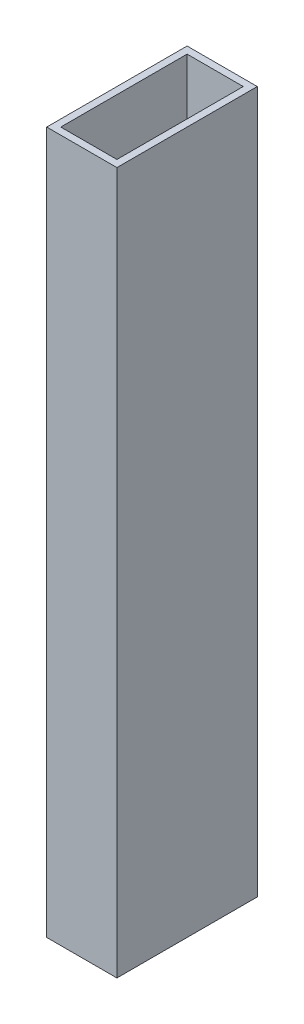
from build123d import *

# Parameters (mm, degrees)
SKETCH1_W           = 10
SKETCH1_H           = 20
SKETCH1_W_2         = 8
SKETCH1_H_2         = 18
BOSS_EXTRUDE1_DEPTH = 100


with BuildPart() as part:
    # Sketch1 → Boss-Extrude1 (new body)
    with BuildSketch(Plane(origin=(0, 0, 0), x_dir=(1, 0, 0), z_dir=(0, 1, 0))):
        Rectangle(SKETCH1_W, SKETCH1_H)
        Rectangle(SKETCH1_W_2, SKETCH1_H_2, mode=Mode.SUBTRACT)
    extrude(amount=BOSS_EXTRUDE1_DEPTH)


solid = part.part
